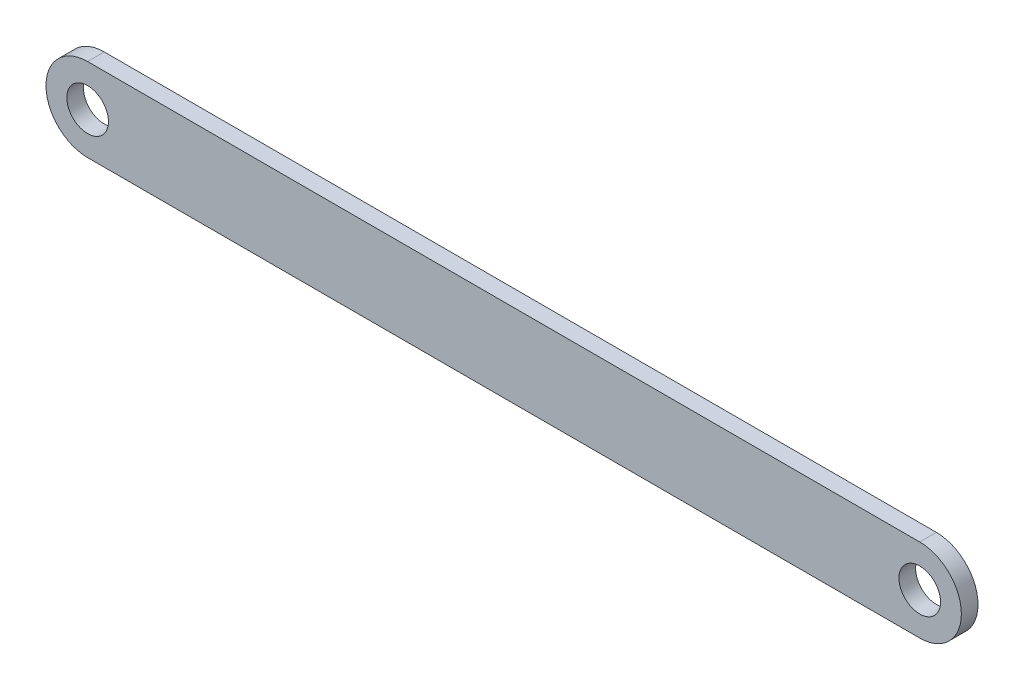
ISO-10303-21;
HEADER;
FILE_DESCRIPTION(('STEP AP214'),'2;1');
FILE_NAME('part.step','',(''),(''),'','','');
FILE_SCHEMA(('AUTOMOTIVE_DESIGN { 1 0 10303 214 1 1 1 1 }'));
ENDSEC;
DATA;
#1=APPLICATION_CONTEXT('core data for automotive mechanical design processes');
#2=APPLICATION_PROTOCOL_DEFINITION('international standard','automotive_design',2000,#1);
#3=PRODUCT_CONTEXT('',#1,'mechanical');
#4=PRODUCT('Part','Part','',(#3));
#5=PRODUCT_RELATED_PRODUCT_CATEGORY('part','',(#4));
#6=PRODUCT_DEFINITION_FORMATION('','',#4);
#7=PRODUCT_DEFINITION_CONTEXT('part definition',#1,'design');
#8=PRODUCT_DEFINITION('design','',#6,#7);
#9=PRODUCT_DEFINITION_SHAPE('','',#8);
#10=(LENGTH_UNIT() NAMED_UNIT(*) SI_UNIT(.MILLI.,.METRE.));
#11=(NAMED_UNIT(*) PLANE_ANGLE_UNIT() SI_UNIT($,.RADIAN.));
#12=(NAMED_UNIT(*) SI_UNIT($,.STERADIAN.) SOLID_ANGLE_UNIT());
#13=UNCERTAINTY_MEASURE_WITH_UNIT(LENGTH_MEASURE(1.E-05),#10,'distance_accuracy_value','');
#14=(GEOMETRIC_REPRESENTATION_CONTEXT(3) GLOBAL_UNCERTAINTY_ASSIGNED_CONTEXT((#13)) GLOBAL_UNIT_ASSIGNED_CONTEXT((#10,
#11,#12)) REPRESENTATION_CONTEXT('',''));
#15=CARTESIAN_POINT('',(0.,0.,0.));
#16=DIRECTION('',(0.,0.,1.));
#17=DIRECTION('',(1.,0.,0.));
#18=AXIS2_PLACEMENT_3D('',#15,#16,#17);
#19=CARTESIAN_POINT('',(-50.,0.,1.));
#20=DIRECTION('',(0.,0.,1.));
#21=DIRECTION('',(1.,0.,0.));
#22=AXIS2_PLACEMENT_3D('',#19,#20,#21);
#23=PLANE('',#22);
#24=CARTESIAN_POINT('',(-50.,0.,1.));
#25=DIRECTION('',(0.,0.,1.));
#26=DIRECTION('',(1.,0.,0.));
#27=AXIS2_PLACEMENT_3D('',#24,#25,#26);
#28=CIRCLE('',#27,2.5);
#29=CARTESIAN_POINT('',(-47.5,0.,1.));
#30=VERTEX_POINT('',#29);
#31=EDGE_CURVE('E112',#30,#30,#28,.T.);
#32=ORIENTED_EDGE('',*,*,#31,.F.);
#33=EDGE_LOOP('',(#32));
#34=FACE_BOUND('',#33,.T.);
#35=CARTESIAN_POINT('',(-50.,0.,1.));
#36=DIRECTION('',(0.,0.,1.));
#37=DIRECTION('',(1.,0.,0.));
#38=AXIS2_PLACEMENT_3D('',#35,#36,#37);
#39=CIRCLE('',#38,5.);
#40=CARTESIAN_POINT('',(-50.,5.00000000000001,1.));
#41=VERTEX_POINT('',#40);
#42=CARTESIAN_POINT('',(-50.,-4.99999999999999,1.));
#43=VERTEX_POINT('',#42);
#44=EDGE_CURVE('E92',#41,#43,#39,.T.);
#45=ORIENTED_EDGE('',*,*,#44,.T.);
#46=DIRECTION('',(1.,0.,0.));
#47=VECTOR('',#46,1.);
#48=CARTESIAN_POINT('',(-50.,-4.99999999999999,1.));
#49=LINE('',#48,#47);
#50=CARTESIAN_POINT('',(50.,-5.,1.));
#51=VERTEX_POINT('',#50);
#52=EDGE_CURVE('E87',#43,#51,#49,.T.);
#53=ORIENTED_EDGE('',*,*,#52,.T.);
#54=CARTESIAN_POINT('',(50.,0.,1.));
#55=DIRECTION('',(0.,0.,1.));
#56=DIRECTION('',(1.,0.,0.));
#57=AXIS2_PLACEMENT_3D('',#54,#55,#56);
#58=CIRCLE('',#57,5.);
#59=CARTESIAN_POINT('',(50.,5.00000000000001,1.));
#60=VERTEX_POINT('',#59);
#61=EDGE_CURVE('E90',#51,#60,#58,.T.);
#62=ORIENTED_EDGE('',*,*,#61,.T.);
#63=DIRECTION('',(-1.,0.,0.));
#64=VECTOR('',#63,1.);
#65=CARTESIAN_POINT('',(-50.,5.00000000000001,1.));
#66=LINE('',#65,#64);
#67=EDGE_CURVE('E57',#60,#41,#66,.T.);
#68=ORIENTED_EDGE('',*,*,#67,.T.);
#69=EDGE_LOOP('',(#45,#53,#62,#68));
#70=FACE_BOUND('',#69,.T.);
#71=CARTESIAN_POINT('',(50.,0.,1.));
#72=DIRECTION('',(0.,0.,1.));
#73=DIRECTION('',(1.,0.,0.));
#74=AXIS2_PLACEMENT_3D('',#71,#72,#73);
#75=CIRCLE('',#74,2.5);
#76=CARTESIAN_POINT('',(52.5,0.,1.));
#77=VERTEX_POINT('',#76);
#78=EDGE_CURVE('E134',#77,#77,#75,.T.);
#79=ORIENTED_EDGE('',*,*,#78,.F.);
#80=EDGE_LOOP('',(#79));
#81=FACE_BOUND('',#80,.T.);
#82=ADVANCED_FACE('F39',(#34,#70,#81),#23,.T.);
#83=CARTESIAN_POINT('',(-50.,0.,-1.));
#84=DIRECTION('',(0.,0.,1.));
#85=DIRECTION('',(1.,0.,0.));
#86=AXIS2_PLACEMENT_3D('',#83,#84,#85);
#87=PLANE('',#86);
#88=CARTESIAN_POINT('',(-50.,0.,-1.));
#89=DIRECTION('',(0.,0.,1.));
#90=DIRECTION('',(1.,0.,0.));
#91=AXIS2_PLACEMENT_3D('',#88,#89,#90);
#92=CIRCLE('',#91,5.);
#93=CARTESIAN_POINT('',(-50.,5.00000000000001,-1.));
#94=VERTEX_POINT('',#93);
#95=CARTESIAN_POINT('',(-50.,-4.99999999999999,-1.));
#96=VERTEX_POINT('',#95);
#97=EDGE_CURVE('E108',#94,#96,#92,.T.);
#98=ORIENTED_EDGE('',*,*,#97,.F.);
#99=DIRECTION('',(-1.,0.,0.));
#100=VECTOR('',#99,1.);
#101=CARTESIAN_POINT('',(-50.,5.00000000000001,-1.));
#102=LINE('',#101,#100);
#103=CARTESIAN_POINT('',(50.,5.00000000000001,-1.));
#104=VERTEX_POINT('',#103);
#105=EDGE_CURVE('E80',#104,#94,#102,.T.);
#106=ORIENTED_EDGE('',*,*,#105,.F.);
#107=CARTESIAN_POINT('',(50.,0.,-1.));
#108=DIRECTION('',(0.,0.,1.));
#109=DIRECTION('',(1.,0.,0.));
#110=AXIS2_PLACEMENT_3D('',#107,#108,#109);
#111=CIRCLE('',#110,5.);
#112=CARTESIAN_POINT('',(50.,-5.,-1.));
#113=VERTEX_POINT('',#112);
#114=EDGE_CURVE('E74',#113,#104,#111,.T.);
#115=ORIENTED_EDGE('',*,*,#114,.F.);
#116=DIRECTION('',(1.,0.,0.));
#117=VECTOR('',#116,1.);
#118=CARTESIAN_POINT('',(-50.,-4.99999999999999,-1.));
#119=LINE('',#118,#117);
#120=EDGE_CURVE('E97',#96,#113,#119,.T.);
#121=ORIENTED_EDGE('',*,*,#120,.F.);
#122=EDGE_LOOP('',(#98,#106,#115,#121));
#123=FACE_BOUND('',#122,.T.);
#124=CARTESIAN_POINT('',(-50.,0.,-1.));
#125=DIRECTION('',(0.,0.,1.));
#126=DIRECTION('',(1.,0.,0.));
#127=AXIS2_PLACEMENT_3D('',#124,#125,#126);
#128=CIRCLE('',#127,2.5);
#129=CARTESIAN_POINT('',(-47.5,0.,-1.));
#130=VERTEX_POINT('',#129);
#131=EDGE_CURVE('E130',#130,#130,#128,.T.);
#132=ORIENTED_EDGE('',*,*,#131,.T.);
#133=EDGE_LOOP('',(#132));
#134=FACE_BOUND('',#133,.T.);
#135=CARTESIAN_POINT('',(50.,0.,-1.));
#136=DIRECTION('',(0.,0.,1.));
#137=DIRECTION('',(1.,0.,0.));
#138=AXIS2_PLACEMENT_3D('',#135,#136,#137);
#139=CIRCLE('',#138,2.5);
#140=CARTESIAN_POINT('',(52.5,0.,-1.));
#141=VERTEX_POINT('',#140);
#142=EDGE_CURVE('E138',#141,#141,#139,.T.);
#143=ORIENTED_EDGE('',*,*,#142,.T.);
#144=EDGE_LOOP('',(#143));
#145=FACE_BOUND('',#144,.T.);
#146=ADVANCED_FACE('F125',(#123,#134,#145),#87,.F.);
#147=CARTESIAN_POINT('',(-50.,0.,1.));
#148=DIRECTION('',(0.,0.,-1.));
#149=DIRECTION('',(-1.,0.,0.));
#150=AXIS2_PLACEMENT_3D('',#147,#148,#149);
#151=CYLINDRICAL_SURFACE('',#150,5.);
#152=ORIENTED_EDGE('',*,*,#97,.T.);
#153=DIRECTION('',(0.,0.,-1.));
#154=VECTOR('',#153,1.);
#155=CARTESIAN_POINT('',(-50.,-4.99999999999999,1.));
#156=LINE('',#155,#154);
#157=EDGE_CURVE('E11',#43,#96,#156,.T.);
#158=ORIENTED_EDGE('',*,*,#157,.F.);
#159=ORIENTED_EDGE('',*,*,#44,.F.);
#160=DIRECTION('',(0.,0.,-1.));
#161=VECTOR('',#160,1.);
#162=CARTESIAN_POINT('',(-50.,5.00000000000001,1.));
#163=LINE('',#162,#161);
#164=EDGE_CURVE('E104',#41,#94,#163,.T.);
#165=ORIENTED_EDGE('',*,*,#164,.T.);
#166=EDGE_LOOP('',(#152,#158,#159,#165));
#167=FACE_BOUND('',#166,.T.);
#168=ADVANCED_FACE('F41',(#167),#151,.T.);
#169=CARTESIAN_POINT('',(-50.,-4.99999999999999,1.));
#170=DIRECTION('',(0.,1.,0.));
#171=DIRECTION('',(0.,0.,1.));
#172=AXIS2_PLACEMENT_3D('',#169,#170,#171);
#173=PLANE('',#172);
#174=ORIENTED_EDGE('',*,*,#120,.T.);
#175=DIRECTION('',(0.,0.,-1.));
#176=VECTOR('',#175,1.);
#177=CARTESIAN_POINT('',(50.,-5.,1.));
#178=LINE('',#177,#176);
#179=EDGE_CURVE('E49',#51,#113,#178,.T.);
#180=ORIENTED_EDGE('',*,*,#179,.F.);
#181=ORIENTED_EDGE('',*,*,#52,.F.);
#182=ORIENTED_EDGE('',*,*,#157,.T.);
#183=EDGE_LOOP('',(#174,#180,#181,#182));
#184=FACE_BOUND('',#183,.T.);
#185=ADVANCED_FACE('F96',(#184),#173,.F.);
#186=CARTESIAN_POINT('',(50.,0.,1.));
#187=DIRECTION('',(0.,0.,-1.));
#188=DIRECTION('',(-1.,0.,0.));
#189=AXIS2_PLACEMENT_3D('',#186,#187,#188);
#190=CYLINDRICAL_SURFACE('',#189,5.);
#191=ORIENTED_EDGE('',*,*,#114,.T.);
#192=DIRECTION('',(0.,0.,-1.));
#193=VECTOR('',#192,1.);
#194=CARTESIAN_POINT('',(50.,5.00000000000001,1.));
#195=LINE('',#194,#193);
#196=EDGE_CURVE('E99',#60,#104,#195,.T.);
#197=ORIENTED_EDGE('',*,*,#196,.F.);
#198=ORIENTED_EDGE('',*,*,#61,.F.);
#199=ORIENTED_EDGE('',*,*,#179,.T.);
#200=EDGE_LOOP('',(#191,#197,#198,#199));
#201=FACE_BOUND('',#200,.T.);
#202=ADVANCED_FACE('F100',(#201),#190,.T.);
#203=CARTESIAN_POINT('',(-50.,5.00000000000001,1.));
#204=DIRECTION('',(0.,-1.,0.));
#205=DIRECTION('',(0.,0.,-1.));
#206=AXIS2_PLACEMENT_3D('',#203,#204,#205);
#207=PLANE('',#206);
#208=ORIENTED_EDGE('',*,*,#105,.T.);
#209=ORIENTED_EDGE('',*,*,#164,.F.);
#210=ORIENTED_EDGE('',*,*,#67,.F.);
#211=ORIENTED_EDGE('',*,*,#196,.T.);
#212=EDGE_LOOP('',(#208,#209,#210,#211));
#213=FACE_BOUND('',#212,.T.);
#214=ADVANCED_FACE('F122',(#213),#207,.F.);
#215=CARTESIAN_POINT('',(-50.,0.,1.));
#216=DIRECTION('',(0.,0.,-1.));
#217=DIRECTION('',(-1.,0.,0.));
#218=AXIS2_PLACEMENT_3D('',#215,#216,#217);
#219=CYLINDRICAL_SURFACE('',#218,2.5);
#220=ORIENTED_EDGE('',*,*,#31,.T.);
#221=EDGE_LOOP('',(#220));
#222=FACE_BOUND('',#221,.T.);
#223=ORIENTED_EDGE('',*,*,#131,.F.);
#224=EDGE_LOOP('',(#223));
#225=FACE_BOUND('',#224,.T.);
#226=ADVANCED_FACE('F157',(#222,#225),#219,.F.);
#227=CARTESIAN_POINT('',(50.,0.,1.));
#228=DIRECTION('',(0.,0.,-1.));
#229=DIRECTION('',(-1.,0.,0.));
#230=AXIS2_PLACEMENT_3D('',#227,#228,#229);
#231=CYLINDRICAL_SURFACE('',#230,2.5);
#232=ORIENTED_EDGE('',*,*,#78,.T.);
#233=EDGE_LOOP('',(#232));
#234=FACE_BOUND('',#233,.T.);
#235=ORIENTED_EDGE('',*,*,#142,.F.);
#236=EDGE_LOOP('',(#235));
#237=FACE_BOUND('',#236,.T.);
#238=ADVANCED_FACE('F146',(#234,#237),#231,.F.);
#239=CLOSED_SHELL('',(#82,#146,#168,#185,#202,#214,#226,#238));
#240=MANIFOLD_SOLID_BREP('B2',#239);
#241=ADVANCED_BREP_SHAPE_REPRESENTATION('',(#18,#240),#14);
#242=SHAPE_DEFINITION_REPRESENTATION(#9,#241);
ENDSEC;
END-ISO-10303-21;
